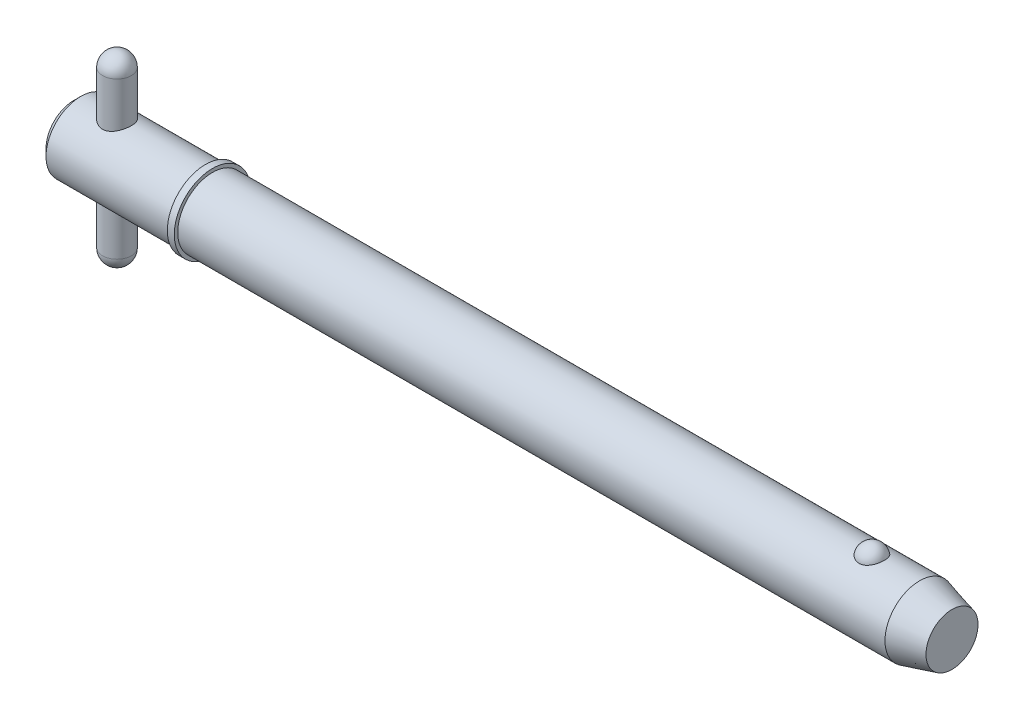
ISO-10303-21;
HEADER;
FILE_DESCRIPTION(('STEP AP214'),'2;1');
FILE_NAME('part.step','',(''),(''),'','','');
FILE_SCHEMA(('AUTOMOTIVE_DESIGN { 1 0 10303 214 1 1 1 1 }'));
ENDSEC;
DATA;
#1=APPLICATION_CONTEXT('core data for automotive mechanical design processes');
#2=APPLICATION_PROTOCOL_DEFINITION('international standard','automotive_design',2000,#1);
#3=PRODUCT_CONTEXT('',#1,'mechanical');
#4=PRODUCT('Part','Part','',(#3));
#5=PRODUCT_RELATED_PRODUCT_CATEGORY('part','',(#4));
#6=PRODUCT_DEFINITION_FORMATION('','',#4);
#7=PRODUCT_DEFINITION_CONTEXT('part definition',#1,'design');
#8=PRODUCT_DEFINITION('design','',#6,#7);
#9=PRODUCT_DEFINITION_SHAPE('','',#8);
#10=(LENGTH_UNIT() NAMED_UNIT(*) SI_UNIT(.MILLI.,.METRE.));
#11=(NAMED_UNIT(*) PLANE_ANGLE_UNIT() SI_UNIT($,.RADIAN.));
#12=(NAMED_UNIT(*) SI_UNIT($,.STERADIAN.) SOLID_ANGLE_UNIT());
#13=UNCERTAINTY_MEASURE_WITH_UNIT(LENGTH_MEASURE(1.E-05),#10,'distance_accuracy_value','');
#14=(GEOMETRIC_REPRESENTATION_CONTEXT(3) GLOBAL_UNCERTAINTY_ASSIGNED_CONTEXT((#13)) GLOBAL_UNIT_ASSIGNED_CONTEXT((#10,
#11,#12)) REPRESENTATION_CONTEXT('',''));
#15=CARTESIAN_POINT('',(0.,0.,0.));
#16=DIRECTION('',(0.,0.,1.));
#17=DIRECTION('',(1.,0.,0.));
#18=AXIS2_PLACEMENT_3D('',#15,#16,#17);
#19=CARTESIAN_POINT('',(5.94,12.7,0.));
#20=DIRECTION('',(0.,-1.,0.));
#21=DIRECTION('',(0.,0.,-1.));
#22=AXIS2_PLACEMENT_3D('',#19,#20,#21);
#23=CYLINDRICAL_SURFACE('',#22,1.98);
#24=CARTESIAN_POINT('',(5.94,-10.72,0.));
#25=DIRECTION('',(0.,-1.,0.));
#26=DIRECTION('',(0.,0.,-1.));
#27=AXIS2_PLACEMENT_3D('',#24,#25,#26);
#28=CIRCLE('',#27,1.98);
#29=CARTESIAN_POINT('',(5.94,-10.72,-1.98));
#30=VERTEX_POINT('',#29);
#31=EDGE_CURVE('P0_E10',#30,#30,#28,.F.);
#32=ORIENTED_EDGE('',*,*,#31,.T.);
#33=EDGE_LOOP('',(#32));
#34=FACE_BOUND('',#33,.T.);
#35=CARTESIAN_POINT('',(5.94,10.72,0.));
#36=DIRECTION('',(0.,-1.,0.));
#37=DIRECTION('',(0.,0.,-1.));
#38=AXIS2_PLACEMENT_3D('',#35,#36,#37);
#39=CIRCLE('',#38,1.98);
#40=CARTESIAN_POINT('',(5.94,10.72,-1.98));
#41=VERTEX_POINT('',#40);
#42=EDGE_CURVE('P0_E21',#41,#41,#39,.T.);
#43=ORIENTED_EDGE('',*,*,#42,.T.);
#44=EDGE_LOOP('',(#43));
#45=FACE_BOUND('',#44,.T.);
#46=ADVANCED_FACE('P0_F14',(#34,#45),#23,.T.);
#47=CARTESIAN_POINT('',(5.94,-10.72,0.));
#48=DIRECTION('',(0.,0.,1.));
#49=DIRECTION('',(1.,0.,0.));
#50=AXIS2_PLACEMENT_3D('',#47,#48,#49);
#51=SPHERICAL_SURFACE('',#50,1.98);
#52=CARTESIAN_POINT('',(5.94,-10.72,0.));
#53=DIRECTION('',(0.,-1.,0.));
#54=DIRECTION('',(0.,0.,-1.));
#55=AXIS2_PLACEMENT_3D('',#52,#53,#54);
#56=SPHERICAL_SURFACE('',#55,1.98);
#57=ORIENTED_EDGE('',*,*,#31,.F.);
#58=EDGE_LOOP('',(#57));
#59=FACE_BOUND('',#58,.T.);
#60=ADVANCED_FACE('P0_F29',(#59),#56,.T.);
#61=CARTESIAN_POINT('',(5.94,10.72,0.));
#62=DIRECTION('',(0.,0.,1.));
#63=DIRECTION('',(1.,0.,0.));
#64=AXIS2_PLACEMENT_3D('',#61,#62,#63);
#65=SPHERICAL_SURFACE('',#64,1.98);
#66=CARTESIAN_POINT('',(5.94,10.72,0.));
#67=DIRECTION('',(0.,-1.,0.));
#68=DIRECTION('',(0.,0.,-1.));
#69=AXIS2_PLACEMENT_3D('',#66,#67,#68);
#70=SPHERICAL_SURFACE('',#69,1.98);
#71=ORIENTED_EDGE('',*,*,#42,.F.);
#72=EDGE_LOOP('',(#71));
#73=FACE_BOUND('',#72,.T.);
#74=ADVANCED_FACE('P0_F16',(#73),#70,.T.);
#75=CLOSED_SHELL('',(#46,#60,#74));
#76=MANIFOLD_SOLID_BREP('P0_B1',#75);
#77=CARTESIAN_POINT('',(0.,0.,0.));
#78=DIRECTION('',(1.,0.,0.));
#79=DIRECTION('',(0.,0.,-1.));
#80=AXIS2_PLACEMENT_3D('',#77,#78,#79);
#81=CYLINDRICAL_SURFACE('',#80,4.765);
#82=CARTESIAN_POINT('',(116.204194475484,0.,0.));
#83=DIRECTION('',(1.,0.,0.));
#84=DIRECTION('',(0.,0.,-1.));
#85=AXIS2_PLACEMENT_3D('',#82,#83,#84);
#86=CIRCLE('',#85,4.765);
#87=CARTESIAN_POINT('',(116.204194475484,0.,-4.765));
#88=VERTEX_POINT('',#87);
#89=EDGE_CURVE('P1_E81',#88,#88,#86,.T.);
#90=ORIENTED_EDGE('',*,*,#89,.F.);
#91=EDGE_LOOP('',(#90));
#92=FACE_BOUND('',#91,.T.);
#93=CARTESIAN_POINT('',(19.05,0.,0.));
#94=DIRECTION('',(1.,0.,0.));
#95=DIRECTION('',(0.,0.,-1.));
#96=AXIS2_PLACEMENT_3D('',#93,#94,#95);
#97=CIRCLE('',#96,4.765);
#98=CARTESIAN_POINT('',(19.05,0.,-4.765));
#99=VERTEX_POINT('',#98);
#100=EDGE_CURVE('P1_E85',#99,#99,#97,.T.);
#101=ORIENTED_EDGE('',*,*,#100,.T.);
#102=EDGE_LOOP('',(#101));
#103=FACE_BOUND('',#102,.T.);
#104=CARTESIAN_POINT('',(109.651020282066,4.42764777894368,1.76101111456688));
#105=CARTESIAN_POINT('',(109.559721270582,4.42764470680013,1.76101422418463));
#106=CARTESIAN_POINT('',(109.468446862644,4.43059091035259,1.75366340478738));
#107=CARTESIAN_POINT('',(109.288615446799,4.44201846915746,1.72451180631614));
#108=CARTESIAN_POINT('',(109.200057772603,4.45049845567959,1.70271460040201));
#109=CARTESIAN_POINT('',(109.028257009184,4.47200516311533,1.6453937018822));
#110=CARTESIAN_POINT('',(108.945006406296,4.48502527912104,1.60988994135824));
#111=CARTESIAN_POINT('',(108.785763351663,4.51419542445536,1.52617873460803));
#112=CARTESIAN_POINT('',(108.709772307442,4.53034605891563,1.47796883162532));
#113=CARTESIAN_POINT('',(108.564744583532,4.5645931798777,1.36860494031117));
#114=CARTESIAN_POINT('',(108.495964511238,4.58273170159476,1.30712420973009));
#115=CARTESIAN_POINT('',(108.369342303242,4.61870302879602,1.17370204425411));
#116=CARTESIAN_POINT('',(108.311502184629,4.63653577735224,1.10175868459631));
#117=CARTESIAN_POINT('',(108.205570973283,4.67090140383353,0.945806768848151));
#118=CARTESIAN_POINT('',(108.158030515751,4.68734068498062,0.861402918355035));
#119=CARTESIAN_POINT('',(108.077081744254,4.71628466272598,0.685442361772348));
#120=CARTESIAN_POINT('',(108.043674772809,4.72878898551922,0.593884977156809));
#121=CARTESIAN_POINT('',(107.991287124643,4.74874061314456,0.404781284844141));
#122=CARTESIAN_POINT('',(107.972517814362,4.75611366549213,0.307168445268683));
#123=CARTESIAN_POINT('',(107.950584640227,4.76475393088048,0.109940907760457));
#124=CARTESIAN_POINT('',(107.947420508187,4.76602124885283,0.0103262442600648));
#125=CARTESIAN_POINT('',(107.956740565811,4.76232928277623,-0.187629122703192));
#126=CARTESIAN_POINT('',(107.969158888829,4.7573962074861,-0.285973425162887));
#127=CARTESIAN_POINT('',(108.009280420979,4.74184975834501,-0.479027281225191));
#128=CARTESIAN_POINT('',(108.036983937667,4.7312362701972,-0.573736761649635));
#129=CARTESIAN_POINT('',(108.107158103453,4.70540026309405,-0.756973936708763));
#130=CARTESIAN_POINT('',(108.149646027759,4.69017235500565,-0.845494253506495));
#131=CARTESIAN_POINT('',(108.248520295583,4.6566986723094,-1.01378033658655));
#132=CARTESIAN_POINT('',(108.304907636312,4.63845268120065,-1.09354547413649));
#133=CARTESIAN_POINT('',(108.430552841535,4.60085438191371,-1.24228523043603));
#134=CARTESIAN_POINT('',(108.499843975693,4.58149930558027,-1.31123108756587));
#135=CARTESIAN_POINT('',(108.649606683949,4.54391653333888,-1.43607409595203));
#136=CARTESIAN_POINT('',(108.730077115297,4.52568872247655,-1.49197257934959));
#137=CARTESIAN_POINT('',(108.898150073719,4.49293007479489,-1.58786764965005));
#138=CARTESIAN_POINT('',(108.985544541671,4.47832346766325,-1.62820219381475));
#139=CARTESIAN_POINT('',(109.166553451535,4.45406011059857,-1.69345757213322));
#140=CARTESIAN_POINT('',(109.26016555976,4.44440151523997,-1.71838415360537));
#141=CARTESIAN_POINT('',(109.445893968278,4.43159888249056,-1.75112843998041));
#142=CARTESIAN_POINT('',(109.537849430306,4.42815213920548,-1.75974223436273));
#143=CARTESIAN_POINT('',(109.721965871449,4.427247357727,-1.76201865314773));
#144=CARTESIAN_POINT('',(109.814126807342,4.42978816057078,-1.7556841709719));
#145=CARTESIAN_POINT('',(109.993129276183,4.4403864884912,-1.72869560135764));
#146=CARTESIAN_POINT('',(110.080047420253,4.44827555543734,-1.70847853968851));
#147=CARTESIAN_POINT('',(110.249131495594,4.46852246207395,-1.65479562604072));
#148=CARTESIAN_POINT('',(110.331297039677,4.48088066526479,-1.62132869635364));
#149=CARTESIAN_POINT('',(110.490591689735,4.50907357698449,-1.54120560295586));
#150=CARTESIAN_POINT('',(110.567570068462,4.52497884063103,-1.49427526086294));
#151=CARTESIAN_POINT('',(110.712708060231,4.55845148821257,-1.38881222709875));
#152=CARTESIAN_POINT('',(110.780865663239,4.57601924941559,-1.33027689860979));
#153=CARTESIAN_POINT('',(110.910099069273,4.61196537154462,-1.19991049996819));
#154=CARTESIAN_POINT('',(110.970656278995,4.63034074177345,-1.12756415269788));
#155=CARTESIAN_POINT('',(111.079279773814,4.66513959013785,-0.973612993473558));
#156=CARTESIAN_POINT('',(111.127343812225,4.68156271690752,-0.892006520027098));
#157=CARTESIAN_POINT('',(111.211383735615,4.71130224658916,-0.718892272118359));
#158=CARTESIAN_POINT('',(111.246918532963,4.724501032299,-0.627149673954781));
#159=CARTESIAN_POINT('',(111.302952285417,4.74571823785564,-0.438611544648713));
#160=CARTESIAN_POINT('',(111.323450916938,4.75373654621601,-0.341815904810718));
#161=CARTESIAN_POINT('',(111.349033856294,4.76378905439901,-0.145633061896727));
#162=CARTESIAN_POINT('',(111.354076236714,4.76580697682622,-0.0462395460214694));
#163=CARTESIAN_POINT('',(111.348523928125,4.76360573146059,0.152038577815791));
#164=CARTESIAN_POINT('',(111.337929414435,4.75938663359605,0.250923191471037));
#165=CARTESIAN_POINT('',(111.301387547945,4.74516937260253,0.445004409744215));
#166=CARTESIAN_POINT('',(111.275496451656,4.73519238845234,0.540213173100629));
#167=CARTESIAN_POINT('',(111.208927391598,4.7104939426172,0.724662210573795));
#168=CARTESIAN_POINT('',(111.168248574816,4.69577220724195,0.813902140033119));
#169=CARTESIAN_POINT('',(111.072717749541,4.66303767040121,0.984313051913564));
#170=CARTESIAN_POINT('',(111.017804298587,4.64501070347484,1.06544688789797));
#171=CARTESIAN_POINT('',(110.895049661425,4.60764678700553,1.21692673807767));
#172=CARTESIAN_POINT('',(110.827208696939,4.58830985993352,1.2872729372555));
#173=CARTESIAN_POINT('',(110.680548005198,4.55060370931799,1.41479271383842));
#174=CARTESIAN_POINT('',(110.601791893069,4.53222967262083,1.4720378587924));
#175=CARTESIAN_POINT('',(110.434989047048,4.49849576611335,1.57212016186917));
#176=CARTESIAN_POINT('',(110.346941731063,4.48313608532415,1.61495641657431));
#177=CARTESIAN_POINT('',(110.159791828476,4.45676184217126,1.68642657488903));
#178=CARTESIAN_POINT('',(110.060365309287,4.44598302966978,1.71430590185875));
#179=CARTESIAN_POINT('',(109.857621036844,4.43142918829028,1.75159258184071));
#180=CARTESIAN_POINT('',(109.754304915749,4.42765125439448,1.76100759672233));
#181=CARTESIAN_POINT('',(109.651020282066,4.42764777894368,1.76101111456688));
#182=B_SPLINE_CURVE_WITH_KNOTS('',3,(#104,#105,#106,#107,#108,#109,#110,#111,#112,#113,#114,
#115,#116,#117,#118,#119,#120,#121,#122,#123,#124,#125,#126,#127,#128,#129,#130,#131,#132,#133,
#134,#135,#136,#137,#138,#139,#140,#141,#142,#143,#144,#145,#146,#147,#148,#149,#150,#151,#152,
#153,#154,#155,#156,#157,#158,#159,#160,#161,#162,#163,#164,#165,#166,#167,#168,#169,#170,#171,
#172,#173,#174,#175,#176,#177,#178,#179,#180,#181),.UNSPECIFIED.,.T.,.F.,(4,2,2,2,2,2,2,2,2,2,2,
2,2,2,2,2,2,2,2,2,2,2,2,2,2,2,2,2,2,2,2,2,2,2,2,2,2,2,4),(0.,0.273517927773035,
0.546968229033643,0.820022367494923,1.09312934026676,1.37393946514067,1.65480131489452,
1.94820420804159,2.24163496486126,2.53922817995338,2.8368162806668,3.13315071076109,
3.42949110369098,3.72617893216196,4.02288805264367,4.32037303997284,4.61782764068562,
4.90840095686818,5.19886582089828,5.4747485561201,5.75057789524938,6.01809977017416,
6.2856434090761,6.55907787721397,6.83257454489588,7.11962987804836,7.40673679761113,
7.70312663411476,7.99952284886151,8.29672237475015,8.59391856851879,8.89002850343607,
9.18615552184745,9.483582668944,9.78100471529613,10.0767610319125,10.3725358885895,
10.6820893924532,10.991514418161),.UNSPECIFIED.);
#183=CARTESIAN_POINT('',(109.651020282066,4.42764777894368,1.76101111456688));
#184=VERTEX_POINT('',#183);
#185=EDGE_CURVE('P1_E35',#184,#184,#182,.T.);
#186=ORIENTED_EDGE('',*,*,#185,.T.);
#187=EDGE_LOOP('',(#186));
#188=FACE_BOUND('',#187,.T.);
#189=ADVANCED_FACE('P1_F13',(#92,#103,#188),#81,.T.);
#190=CARTESIAN_POINT('',(0.,0.,0.));
#191=DIRECTION('',(-1.,0.,0.));
#192=DIRECTION('',(0.,0.,1.));
#193=AXIS2_PLACEMENT_3D('',#190,#191,#192);
#194=PLANE('',#193);
#195=CARTESIAN_POINT('',(0.,0.,0.));
#196=DIRECTION('',(1.,0.,0.));
#197=DIRECTION('',(0.,0.,-1.));
#198=AXIS2_PLACEMENT_3D('',#195,#196,#197);
#199=CIRCLE('',#198,3.812);
#200=CARTESIAN_POINT('',(0.,0.,-3.812));
#201=VERTEX_POINT('',#200);
#202=EDGE_CURVE('P1_E9',#201,#201,#199,.T.);
#203=ORIENTED_EDGE('',*,*,#202,.F.);
#204=EDGE_LOOP('',(#203));
#205=FACE_BOUND('',#204,.T.);
#206=ADVANCED_FACE('P1_F15',(#205),#194,.T.);
#207=CARTESIAN_POINT('',(0.952999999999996,0.,0.));
#208=DIRECTION('',(1.,0.,0.));
#209=DIRECTION('',(0.,0.,-1.));
#210=AXIS2_PLACEMENT_3D('',#207,#208,#209);
#211=CONICAL_SURFACE('',#210,4.765,0.78539816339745);
#212=ORIENTED_EDGE('',*,*,#202,.T.);
#213=EDGE_LOOP('',(#212));
#214=FACE_BOUND('',#213,.T.);
#215=CARTESIAN_POINT('',(0.952999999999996,0.,0.));
#216=DIRECTION('',(1.,0.,0.));
#217=DIRECTION('',(0.,0.,-1.));
#218=AXIS2_PLACEMENT_3D('',#215,#216,#217);
#219=CIRCLE('',#218,4.765);
#220=CARTESIAN_POINT('',(0.952999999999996,0.,-4.765));
#221=VERTEX_POINT('',#220);
#222=EDGE_CURVE('P1_E26',#221,#221,#219,.T.);
#223=ORIENTED_EDGE('',*,*,#222,.F.);
#224=EDGE_LOOP('',(#223));
#225=FACE_BOUND('',#224,.T.);
#226=ADVANCED_FACE('P1_F77',(#214,#225),#211,.T.);
#227=CARTESIAN_POINT('',(0.,0.,0.));
#228=DIRECTION('',(1.,0.,0.));
#229=DIRECTION('',(0.,0.,-1.));
#230=AXIS2_PLACEMENT_3D('',#227,#228,#229);
#231=CYLINDRICAL_SURFACE('',#230,4.765);
#232=CARTESIAN_POINT('',(5.94,-4.33414639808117,1.98));
#233=CARTESIAN_POINT('',(5.83435484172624,-4.33415447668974,1.97999169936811));
#234=CARTESIAN_POINT('',(5.72854887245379,-4.33806396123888,1.97149330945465));
#235=CARTESIAN_POINT('',(5.51998191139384,-4.35319906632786,1.93783487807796));
#236=CARTESIAN_POINT('',(5.41723000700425,-4.3644446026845,1.91262947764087));
#237=CARTESIAN_POINT('',(5.21817294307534,-4.39274225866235,1.84670269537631));
#238=CARTESIAN_POINT('',(5.12184344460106,-4.40977076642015,1.80604432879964));
#239=CARTESIAN_POINT('',(4.93740039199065,-4.44768106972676,1.71055160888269));
#240=CARTESIAN_POINT('',(4.84928487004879,-4.46856193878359,1.65572066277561));
#241=CARTESIAN_POINT('',(4.67826533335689,-4.51326966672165,1.52981120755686));
#242=CARTESIAN_POINT('',(4.59593118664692,-4.53719608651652,1.45799365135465));
#243=CARTESIAN_POINT('',(4.44405452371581,-4.58448035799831,1.30170177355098));
#244=CARTESIAN_POINT('',(4.37451692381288,-4.60783798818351,1.21722260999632));
#245=CARTESIAN_POINT('',(4.24730683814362,-4.65256187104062,1.03353484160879));
#246=CARTESIAN_POINT('',(4.19027484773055,-4.67379892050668,0.933848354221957));
#247=CARTESIAN_POINT('',(4.0940363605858,-4.7106711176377,0.7252544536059));
#248=CARTESIAN_POINT('',(4.05482199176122,-4.72630873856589,0.61635113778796));
#249=CARTESIAN_POINT('',(3.99739515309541,-4.74951416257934,0.398397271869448));
#250=CARTESIAN_POINT('',(3.97820018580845,-4.7574579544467,0.289646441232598));
#251=CARTESIAN_POINT('',(3.95818309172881,-4.76574596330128,0.0701967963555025));
#252=CARTESIAN_POINT('',(3.95735355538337,-4.76609324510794,-0.0405012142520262));
#253=CARTESIAN_POINT('',(3.9735743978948,-4.75937098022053,-0.253561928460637));
#254=CARTESIAN_POINT('',(3.98954548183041,-4.75274912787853,-0.356023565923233));
#255=CARTESIAN_POINT('',(4.03706504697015,-4.73344665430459,-0.556659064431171));
#256=CARTESIAN_POINT('',(4.06861467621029,-4.72076558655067,-0.654832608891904));
#257=CARTESIAN_POINT('',(4.14677192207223,-4.69032846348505,-0.845904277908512));
#258=CARTESIAN_POINT('',(4.19360181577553,-4.67249797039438,-0.938699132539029));
#259=CARTESIAN_POINT('',(4.30077315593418,-4.63350852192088,-1.11535616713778));
#260=CARTESIAN_POINT('',(4.3611193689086,-4.61234839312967,-1.19921518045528));
#261=CARTESIAN_POINT('',(4.49853487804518,-4.56707259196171,-1.3618711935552));
#262=CARTESIAN_POINT('',(4.57648039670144,-4.5428537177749,-1.43990029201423));
#263=CARTESIAN_POINT('',(4.74440779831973,-4.49530722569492,-1.58211009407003));
#264=CARTESIAN_POINT('',(4.83439425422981,-4.47197995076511,-1.64628551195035));
#265=CARTESIAN_POINT('',(5.02755026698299,-4.42812342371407,-1.76092221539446));
#266=CARTESIAN_POINT('',(5.13105348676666,-4.40770990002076,-1.81086937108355));
#267=CARTESIAN_POINT('',(5.34607555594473,-4.37336901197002,-1.89231211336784));
#268=CARTESIAN_POINT('',(5.45758864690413,-4.3594370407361,-1.92382080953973));
#269=CARTESIAN_POINT('',(5.67777275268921,-4.34077746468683,-1.96554536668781));
#270=CARTESIAN_POINT('',(5.78616167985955,-4.33551319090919,-1.9770057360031));
#271=CARTESIAN_POINT('',(6.00341835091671,-4.33325118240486,-1.98196183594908));
#272=CARTESIAN_POINT('',(6.11228591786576,-4.33625061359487,-1.97546372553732));
#273=CARTESIAN_POINT('',(6.32012423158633,-4.34962383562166,-1.94582288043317));
#274=CARTESIAN_POINT('',(6.41928436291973,-4.35951709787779,-1.92376364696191));
#275=CARTESIAN_POINT('',(6.61241543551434,-4.38495043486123,-1.86506038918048));
#276=CARTESIAN_POINT('',(6.70638516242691,-4.40049182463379,-1.82841296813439));
#277=CARTESIAN_POINT('',(6.89090272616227,-4.43627016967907,-1.73985559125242));
#278=CARTESIAN_POINT('',(6.98113841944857,-4.45667771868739,-1.68736639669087));
#279=CARTESIAN_POINT('',(7.1519532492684,-4.49964530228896,-1.56919282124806));
#280=CARTESIAN_POINT('',(7.232528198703,-4.52220626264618,-1.50350275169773));
#281=CARTESIAN_POINT('',(7.38851617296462,-4.56914071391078,-1.35452895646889));
#282=CARTESIAN_POINT('',(7.46298462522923,-4.5935132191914,-1.27025197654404));
#283=CARTESIAN_POINT('',(7.59689029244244,-4.63962841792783,-1.08983181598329));
#284=CARTESIAN_POINT('',(7.65632644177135,-4.66137092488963,-0.993687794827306));
#285=CARTESIAN_POINT('',(7.75840361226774,-4.69991192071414,-0.791608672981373));
#286=CARTESIAN_POINT('',(7.80100481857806,-4.71669866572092,-0.685651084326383));
#287=CARTESIAN_POINT('',(7.86746997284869,-4.74331408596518,-0.467197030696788));
#288=CARTESIAN_POINT('',(7.8913450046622,-4.75314687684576,-0.354704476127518));
#289=CARTESIAN_POINT('',(7.91828971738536,-4.76427543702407,-0.134819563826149));
#290=CARTESIAN_POINT('',(7.92269147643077,-4.76611762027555,-0.027616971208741));
#291=CARTESIAN_POINT('',(7.91414154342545,-4.76256684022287,0.185959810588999));
#292=CARTESIAN_POINT('',(7.90119286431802,-4.75717513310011,0.292334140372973));
#293=CARTESIAN_POINT('',(7.85926572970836,-4.74004856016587,0.497383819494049));
#294=CARTESIAN_POINT('',(7.83086647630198,-4.72854322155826,0.596198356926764));
#295=CARTESIAN_POINT('',(7.75947503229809,-4.70045111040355,0.787624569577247));
#296=CARTESIAN_POINT('',(7.71648006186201,-4.68386336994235,0.880235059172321));
#297=CARTESIAN_POINT('',(7.6149456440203,-4.64628321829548,1.06122875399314));
#298=CARTESIAN_POINT('',(7.55579211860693,-4.62512577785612,1.14923242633));
#299=CARTESIAN_POINT('',(7.42451813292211,-4.58091700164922,1.31443888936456));
#300=CARTESIAN_POINT('',(7.35239289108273,-4.5578649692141,1.39163767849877));
#301=CARTESIAN_POINT('',(7.19146107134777,-4.51050832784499,1.53847013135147));
#302=CARTESIAN_POINT('',(7.10185635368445,-4.48622440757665,1.60723941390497));
#303=CARTESIAN_POINT('',(6.91164948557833,-4.44076541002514,1.72888900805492));
#304=CARTESIAN_POINT('',(6.81104124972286,-4.41959206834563,1.78176046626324));
#305=CARTESIAN_POINT('',(6.60181953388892,-4.38318936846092,1.86953227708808));
#306=CARTESIAN_POINT('',(6.49325511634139,-4.3679267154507,1.90453365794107));
#307=CARTESIAN_POINT('',(6.32681512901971,-4.35102038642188,1.94268459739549));
#308=CARTESIAN_POINT('',(6.27079191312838,-4.34638447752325,1.953006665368));
#309=CARTESIAN_POINT('',(6.15793999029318,-4.33925923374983,1.96879053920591));
#310=CARTESIAN_POINT('',(6.10111188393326,-4.33676837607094,1.97425579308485));
#311=CARTESIAN_POINT('',(6.00947316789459,-4.33456308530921,1.97908711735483));
#312=CARTESIAN_POINT('',(5.97474528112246,-4.33414374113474,1.98000272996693));
#313=CARTESIAN_POINT('',(5.94,-4.33414639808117,1.98));
#314=B_SPLINE_CURVE_WITH_KNOTS('',3,(#232,#233,#234,#235,#236,#237,#238,#239,#240,#241,#242,
#243,#244,#245,#246,#247,#248,#249,#250,#251,#252,#253,#254,#255,#256,#257,#258,#259,#260,#261,
#262,#263,#264,#265,#266,#267,#268,#269,#270,#271,#272,#273,#274,#275,#276,#277,#278,#279,#280,
#281,#282,#283,#284,#285,#286,#287,#288,#289,#290,#291,#292,#293,#294,#295,#296,#297,#298,#299,
#300,#301,#302,#303,#304,#305,#306,#307,#308,#309,#310,#311,#312,#313),.UNSPECIFIED.,.T.,.F.,(4,
2,2,2,2,2,2,2,2,2,2,2,2,2,2,2,2,2,2,2,2,2,2,2,2,2,2,2,2,2,2,2,2,2,2,2,2,2,2,2,4),(0.,
0.316814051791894,0.634491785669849,0.950887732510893,1.2672076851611,1.60127705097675,
1.93547449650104,2.28407463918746,2.63252061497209,2.96292077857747,3.29318763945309,
3.60346227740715,3.91375978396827,4.22878888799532,4.54392926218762,4.88117914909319,
5.21855748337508,5.56691259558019,5.91501972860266,6.24062939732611,6.56612741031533,
6.87094948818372,7.17584258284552,7.49361276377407,7.81152017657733,8.15513975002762,
8.4987836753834,8.8432355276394,9.18748334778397,9.50777781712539,9.8280166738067,
10.1370037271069,10.4460496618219,10.7690461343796,11.0921619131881,11.4371238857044,
11.7822776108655,12.1254577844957,12.2967183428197,12.4678572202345,12.5720531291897),.UNSPECIFIED.);
#315=CARTESIAN_POINT('',(5.94,-4.33414639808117,1.98));
#316=VERTEX_POINT('',#315);
#317=EDGE_CURVE('P1_E17',#316,#316,#314,.T.);
#318=ORIENTED_EDGE('',*,*,#317,.F.);
#319=EDGE_LOOP('',(#318));
#320=FACE_BOUND('',#319,.T.);
#321=CARTESIAN_POINT('',(5.94,4.33414639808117,1.98));
#322=CARTESIAN_POINT('',(6.04564515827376,4.33415447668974,1.97999169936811));
#323=CARTESIAN_POINT('',(6.15145112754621,4.33806396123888,1.97149330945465));
#324=CARTESIAN_POINT('',(6.36001808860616,4.35319906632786,1.93783487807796));
#325=CARTESIAN_POINT('',(6.46276999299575,4.3644446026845,1.91262947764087));
#326=CARTESIAN_POINT('',(6.66182705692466,4.39274225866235,1.84670269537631));
#327=CARTESIAN_POINT('',(6.75815655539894,4.40977076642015,1.80604432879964));
#328=CARTESIAN_POINT('',(6.94259960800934,4.44768106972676,1.71055160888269));
#329=CARTESIAN_POINT('',(7.03071512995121,4.46856193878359,1.65572066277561));
#330=CARTESIAN_POINT('',(7.20173466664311,4.51326966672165,1.52981120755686));
#331=CARTESIAN_POINT('',(7.28406881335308,4.53719608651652,1.45799365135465));
#332=CARTESIAN_POINT('',(7.43594547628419,4.58448035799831,1.30170177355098));
#333=CARTESIAN_POINT('',(7.50548307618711,4.60783798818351,1.21722260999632));
#334=CARTESIAN_POINT('',(7.63269316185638,4.65256187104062,1.03353484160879));
#335=CARTESIAN_POINT('',(7.68972515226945,4.67379892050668,0.933848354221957));
#336=CARTESIAN_POINT('',(7.7859636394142,4.7106711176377,0.7252544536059));
#337=CARTESIAN_POINT('',(7.82517800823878,4.72630873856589,0.61635113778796));
#338=CARTESIAN_POINT('',(7.88260484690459,4.74951416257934,0.398397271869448));
#339=CARTESIAN_POINT('',(7.90179981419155,4.7574579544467,0.289646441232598));
#340=CARTESIAN_POINT('',(7.92181690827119,4.76574596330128,0.0701967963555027));
#341=CARTESIAN_POINT('',(7.92264644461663,4.76609324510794,-0.040501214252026));
#342=CARTESIAN_POINT('',(7.9064256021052,4.75937098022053,-0.253561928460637));
#343=CARTESIAN_POINT('',(7.89045451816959,4.75274912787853,-0.356023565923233));
#344=CARTESIAN_POINT('',(7.84293495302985,4.73344665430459,-0.55665906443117));
#345=CARTESIAN_POINT('',(7.81138532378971,4.72076558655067,-0.654832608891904));
#346=CARTESIAN_POINT('',(7.73322807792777,4.69032846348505,-0.845904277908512));
#347=CARTESIAN_POINT('',(7.68639818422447,4.67249797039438,-0.938699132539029));
#348=CARTESIAN_POINT('',(7.57922684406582,4.63350852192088,-1.11535616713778));
#349=CARTESIAN_POINT('',(7.5188806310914,4.61234839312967,-1.19921518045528));
#350=CARTESIAN_POINT('',(7.38146512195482,4.56707259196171,-1.3618711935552));
#351=CARTESIAN_POINT('',(7.30351960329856,4.5428537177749,-1.43990029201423));
#352=CARTESIAN_POINT('',(7.13559220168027,4.49530722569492,-1.58211009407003));
#353=CARTESIAN_POINT('',(7.04560574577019,4.47197995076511,-1.64628551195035));
#354=CARTESIAN_POINT('',(6.85244973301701,4.42812342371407,-1.76092221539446));
#355=CARTESIAN_POINT('',(6.74894651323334,4.40770990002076,-1.81086937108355));
#356=CARTESIAN_POINT('',(6.53392444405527,4.37336901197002,-1.89231211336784));
#357=CARTESIAN_POINT('',(6.42241135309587,4.3594370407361,-1.92382080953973));
#358=CARTESIAN_POINT('',(6.20222724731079,4.34077746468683,-1.96554536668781));
#359=CARTESIAN_POINT('',(6.09383832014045,4.33551319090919,-1.9770057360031));
#360=CARTESIAN_POINT('',(5.87658164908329,4.33325118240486,-1.98196183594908));
#361=CARTESIAN_POINT('',(5.76771408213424,4.33625061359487,-1.97546372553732));
#362=CARTESIAN_POINT('',(5.55987576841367,4.34962383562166,-1.94582288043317));
#363=CARTESIAN_POINT('',(5.46071563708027,4.35951709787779,-1.92376364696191));
#364=CARTESIAN_POINT('',(5.26758456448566,4.38495043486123,-1.86506038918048));
#365=CARTESIAN_POINT('',(5.17361483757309,4.40049182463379,-1.82841296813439));
#366=CARTESIAN_POINT('',(4.98909727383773,4.43627016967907,-1.73985559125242));
#367=CARTESIAN_POINT('',(4.89886158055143,4.45667771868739,-1.68736639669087));
#368=CARTESIAN_POINT('',(4.72804675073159,4.49964530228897,-1.56919282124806));
#369=CARTESIAN_POINT('',(4.647471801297,4.52220626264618,-1.50350275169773));
#370=CARTESIAN_POINT('',(4.49148382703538,4.56914071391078,-1.35452895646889));
#371=CARTESIAN_POINT('',(4.41701537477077,4.5935132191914,-1.27025197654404));
#372=CARTESIAN_POINT('',(4.28310970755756,4.63962841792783,-1.08983181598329));
#373=CARTESIAN_POINT('',(4.22367355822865,4.66137092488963,-0.993687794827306));
#374=CARTESIAN_POINT('',(4.12159638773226,4.69991192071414,-0.791608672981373));
#375=CARTESIAN_POINT('',(4.07899518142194,4.71669866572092,-0.685651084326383));
#376=CARTESIAN_POINT('',(4.01253002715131,4.74331408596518,-0.467197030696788));
#377=CARTESIAN_POINT('',(3.98865499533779,4.75314687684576,-0.354704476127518));
#378=CARTESIAN_POINT('',(3.96171028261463,4.76427543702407,-0.134819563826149));
#379=CARTESIAN_POINT('',(3.95730852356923,4.76611762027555,-0.0276169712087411));
#380=CARTESIAN_POINT('',(3.96585845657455,4.76256684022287,0.185959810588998));
#381=CARTESIAN_POINT('',(3.97880713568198,4.75717513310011,0.292334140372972));
#382=CARTESIAN_POINT('',(4.02073427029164,4.74004856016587,0.497383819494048));
#383=CARTESIAN_POINT('',(4.04913352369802,4.72854322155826,0.596198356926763));
#384=CARTESIAN_POINT('',(4.12052496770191,4.70045111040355,0.787624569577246));
#385=CARTESIAN_POINT('',(4.16351993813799,4.68386336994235,0.880235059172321));
#386=CARTESIAN_POINT('',(4.2650543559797,4.64628321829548,1.06122875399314));
#387=CARTESIAN_POINT('',(4.32420788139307,4.62512577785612,1.14923242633));
#388=CARTESIAN_POINT('',(4.45548186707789,4.58091700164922,1.31443888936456));
#389=CARTESIAN_POINT('',(4.52760710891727,4.5578649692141,1.39163767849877));
#390=CARTESIAN_POINT('',(4.68853892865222,4.51050832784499,1.53847013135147));
#391=CARTESIAN_POINT('',(4.77814364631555,4.48622440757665,1.60723941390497));
#392=CARTESIAN_POINT('',(4.96835051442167,4.44076541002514,1.72888900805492));
#393=CARTESIAN_POINT('',(5.06895875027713,4.41959206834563,1.78176046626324));
#394=CARTESIAN_POINT('',(5.27818046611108,4.38318936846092,1.86953227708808));
#395=CARTESIAN_POINT('',(5.38674488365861,4.3679267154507,1.90453365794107));
#396=CARTESIAN_POINT('',(5.55318487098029,4.35102038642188,1.94268459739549));
#397=CARTESIAN_POINT('',(5.60920808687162,4.34638447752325,1.953006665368));
#398=CARTESIAN_POINT('',(5.72206000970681,4.33925923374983,1.96879053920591));
#399=CARTESIAN_POINT('',(5.77888811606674,4.33676837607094,1.97425579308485));
#400=CARTESIAN_POINT('',(5.87052683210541,4.33456308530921,1.97908711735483));
#401=CARTESIAN_POINT('',(5.90525471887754,4.33414374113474,1.98000272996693));
#402=CARTESIAN_POINT('',(5.94,4.33414639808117,1.98));
#403=B_SPLINE_CURVE_WITH_KNOTS('',3,(#321,#322,#323,#324,#325,#326,#327,#328,#329,#330,#331,
#332,#333,#334,#335,#336,#337,#338,#339,#340,#341,#342,#343,#344,#345,#346,#347,#348,#349,#350,
#351,#352,#353,#354,#355,#356,#357,#358,#359,#360,#361,#362,#363,#364,#365,#366,#367,#368,#369,
#370,#371,#372,#373,#374,#375,#376,#377,#378,#379,#380,#381,#382,#383,#384,#385,#386,#387,#388,
#389,#390,#391,#392,#393,#394,#395,#396,#397,#398,#399,#400,#401,#402),.UNSPECIFIED.,.T.,.F.,(4,
2,2,2,2,2,2,2,2,2,2,2,2,2,2,2,2,2,2,2,2,2,2,2,2,2,2,2,2,2,2,2,2,2,2,2,2,2,2,2,4),(0.,
0.316814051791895,0.634491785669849,0.950887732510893,1.2672076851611,1.60127705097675,
1.93547449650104,2.28407463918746,2.63252061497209,2.96292077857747,3.29318763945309,
3.60346227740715,3.91375978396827,4.22878888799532,4.54392926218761,4.88117914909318,
5.21855748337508,5.56691259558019,5.91501972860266,6.24062939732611,6.56612741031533,
6.87094948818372,7.17584258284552,7.49361276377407,7.81152017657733,8.15513975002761,
8.4987836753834,8.84323552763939,9.18748334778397,9.50777781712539,9.8280166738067,
10.1370037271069,10.4460496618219,10.7690461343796,11.0921619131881,11.4371238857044,
11.7822776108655,12.1254577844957,12.2967183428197,12.4678572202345,12.5720531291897),.UNSPECIFIED.);
#404=CARTESIAN_POINT('',(5.94,4.33414639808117,1.98));
#405=VERTEX_POINT('',#404);
#406=EDGE_CURVE('P1_E43',#405,#405,#403,.T.);
#407=ORIENTED_EDGE('',*,*,#406,.F.);
#408=EDGE_LOOP('',(#407));
#409=FACE_BOUND('',#408,.T.);
#410=ORIENTED_EDGE('',*,*,#222,.T.);
#411=EDGE_LOOP('',(#410));
#412=FACE_BOUND('',#411,.T.);
#413=CARTESIAN_POINT('',(18.097,0.,0.));
#414=DIRECTION('',(1.,0.,0.));
#415=DIRECTION('',(0.,0.,-1.));
#416=AXIS2_PLACEMENT_3D('',#413,#414,#415);
#417=CIRCLE('',#416,4.765);
#418=CARTESIAN_POINT('',(18.097,0.,-4.765));
#419=VERTEX_POINT('',#418);
#420=EDGE_CURVE('P1_E31',#419,#419,#417,.T.);
#421=ORIENTED_EDGE('',*,*,#420,.F.);
#422=EDGE_LOOP('',(#421));
#423=FACE_BOUND('',#422,.T.);
#424=ADVANCED_FACE('P1_F103',(#320,#409,#412,#423),#231,.T.);
#425=CARTESIAN_POINT('',(18.097,4.765,0.));
#426=DIRECTION('',(-1.,0.,0.));
#427=DIRECTION('',(0.,0.,1.));
#428=AXIS2_PLACEMENT_3D('',#425,#426,#427);
#429=PLANE('',#428);
#430=ORIENTED_EDGE('',*,*,#420,.T.);
#431=EDGE_LOOP('',(#430));
#432=FACE_BOUND('',#431,.T.);
#433=CARTESIAN_POINT('',(18.097,0.,0.));
#434=DIRECTION('',(1.,0.,0.));
#435=DIRECTION('',(0.,0.,-1.));
#436=AXIS2_PLACEMENT_3D('',#433,#434,#435);
#437=CIRCLE('',#436,5.2415);
#438=CARTESIAN_POINT('',(18.097,0.,-5.2415));
#439=VERTEX_POINT('',#438);
#440=EDGE_CURVE('P1_E91',#439,#439,#437,.T.);
#441=ORIENTED_EDGE('',*,*,#440,.F.);
#442=EDGE_LOOP('',(#441));
#443=FACE_BOUND('',#442,.T.);
#444=ADVANCED_FACE('P1_F100',(#432,#443),#429,.T.);
#445=CARTESIAN_POINT('',(0.,0.,0.));
#446=DIRECTION('',(1.,0.,0.));
#447=DIRECTION('',(0.,0.,-1.));
#448=AXIS2_PLACEMENT_3D('',#445,#446,#447);
#449=CYLINDRICAL_SURFACE('',#448,5.2415);
#450=ORIENTED_EDGE('',*,*,#440,.T.);
#451=EDGE_LOOP('',(#450));
#452=FACE_BOUND('',#451,.T.);
#453=CARTESIAN_POINT('',(19.05,0.,0.));
#454=DIRECTION('',(1.,0.,0.));
#455=DIRECTION('',(0.,0.,-1.));
#456=AXIS2_PLACEMENT_3D('',#453,#454,#455);
#457=CIRCLE('',#456,5.2415);
#458=CARTESIAN_POINT('',(19.05,0.,-5.2415));
#459=VERTEX_POINT('',#458);
#460=EDGE_CURVE('P1_E88',#459,#459,#457,.T.);
#461=ORIENTED_EDGE('',*,*,#460,.F.);
#462=EDGE_LOOP('',(#461));
#463=FACE_BOUND('',#462,.T.);
#464=ADVANCED_FACE('P1_F68',(#452,#463),#449,.T.);
#465=CARTESIAN_POINT('',(19.05,5.2415,0.));
#466=DIRECTION('',(1.,0.,0.));
#467=DIRECTION('',(0.,0.,-1.));
#468=AXIS2_PLACEMENT_3D('',#465,#466,#467);
#469=PLANE('',#468);
#470=ORIENTED_EDGE('',*,*,#460,.T.);
#471=EDGE_LOOP('',(#470));
#472=FACE_BOUND('',#471,.T.);
#473=ORIENTED_EDGE('',*,*,#100,.F.);
#474=EDGE_LOOP('',(#473));
#475=FACE_BOUND('',#474,.T.);
#476=ADVANCED_FACE('P1_F62',(#472,#475),#469,.T.);
#477=CARTESIAN_POINT('',(120.65,0.,0.));
#478=DIRECTION('',(-1.,0.,0.));
#479=DIRECTION('',(0.,0.,1.));
#480=AXIS2_PLACEMENT_3D('',#477,#478,#479);
#481=CONICAL_SURFACE('',#480,3.57375000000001,0.26179938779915);
#482=ORIENTED_EDGE('',*,*,#89,.T.);
#483=EDGE_LOOP('',(#482));
#484=FACE_BOUND('',#483,.T.);
#485=CARTESIAN_POINT('',(120.65,0.,0.));
#486=DIRECTION('',(1.,0.,0.));
#487=DIRECTION('',(0.,0.,-1.));
#488=AXIS2_PLACEMENT_3D('',#485,#486,#487);
#489=CIRCLE('',#488,3.57375000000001);
#490=CARTESIAN_POINT('',(120.65,0.,-3.57375000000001));
#491=VERTEX_POINT('',#490);
#492=EDGE_CURVE('P1_E42',#491,#491,#489,.T.);
#493=ORIENTED_EDGE('',*,*,#492,.F.);
#494=EDGE_LOOP('',(#493));
#495=FACE_BOUND('',#494,.T.);
#496=ADVANCED_FACE('P1_F59',(#484,#495),#481,.T.);
#497=CARTESIAN_POINT('',(120.65,3.57375000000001,0.));
#498=DIRECTION('',(1.,0.,0.));
#499=DIRECTION('',(0.,0.,-1.));
#500=AXIS2_PLACEMENT_3D('',#497,#498,#499);
#501=PLANE('',#500);
#502=ORIENTED_EDGE('',*,*,#492,.T.);
#503=EDGE_LOOP('',(#502));
#504=FACE_BOUND('',#503,.T.);
#505=ADVANCED_FACE('P1_F55',(#504),#501,.T.);
#506=CARTESIAN_POINT('',(109.651020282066,4.2885,0.));
#507=DIRECTION('',(-1.,0.,0.));
#508=DIRECTION('',(0.,1.,0.));
#509=AXIS2_PLACEMENT_3D('',#506,#507,#508);
#510=SPHERICAL_SURFACE('',#509,1.7665);
#511=ORIENTED_EDGE('',*,*,#185,.F.);
#512=EDGE_LOOP('',(#511));
#513=FACE_BOUND('',#512,.T.);
#514=ADVANCED_FACE('P1_F50',(#513),#510,.T.);
#515=CARTESIAN_POINT('',(5.94,-5.2415,0.));
#516=DIRECTION('',(0.,1.,0.));
#517=DIRECTION('',(0.,0.,1.));
#518=AXIS2_PLACEMENT_3D('',#515,#516,#517);
#519=CYLINDRICAL_SURFACE('',#518,1.98);
#520=ORIENTED_EDGE('',*,*,#317,.T.);
#521=EDGE_LOOP('',(#520));
#522=FACE_BOUND('',#521,.T.);
#523=ORIENTED_EDGE('',*,*,#406,.T.);
#524=EDGE_LOOP('',(#523));
#525=FACE_BOUND('',#524,.T.);
#526=ADVANCED_FACE('P1_F54',(#522,#525),#519,.F.);
#527=CLOSED_SHELL('',(#189,#206,#226,#424,#444,#464,#476,#496,#505,#514,#526));
#528=MANIFOLD_SOLID_BREP('P1_B1',#527);
#529=ADVANCED_BREP_SHAPE_REPRESENTATION('',(#18,#76,#528),#14);
#530=SHAPE_DEFINITION_REPRESENTATION(#9,#529);
ENDSEC;
END-ISO-10303-21;
